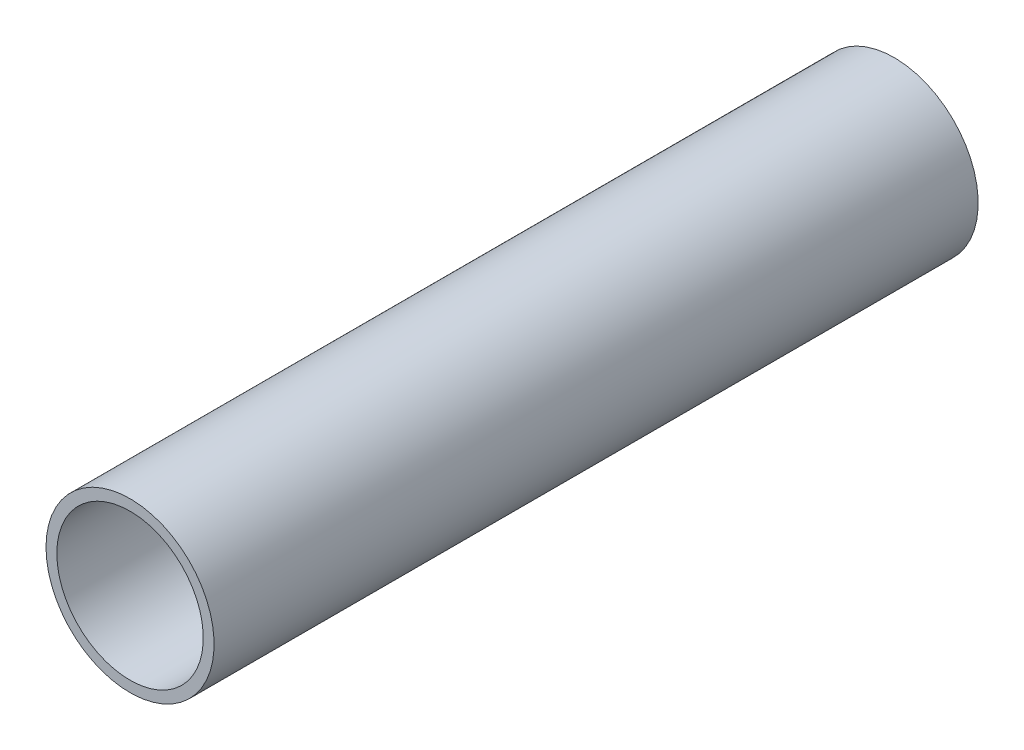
from build123d import *

# Parameters (mm, degrees)
SKETCH1_R           = 16.764
SKETCH1_R_2         = 14.605
BOSS_EXTRUDE1_DEPTH = 152.4


with BuildPart() as part:
    # Sketch1 → Boss-Extrude1 (new body)
    with BuildSketch(Plane.XY):
        with Locations(Location((0, 0, 0), (0, 0, 180))):
            Circle(SKETCH1_R)
        with Locations(Location((0, 0, 0), (0, 0, 180))):
            Circle(SKETCH1_R_2, mode=Mode.SUBTRACT)
    extrude(amount=BOSS_EXTRUDE1_DEPTH)


solid = part.part
